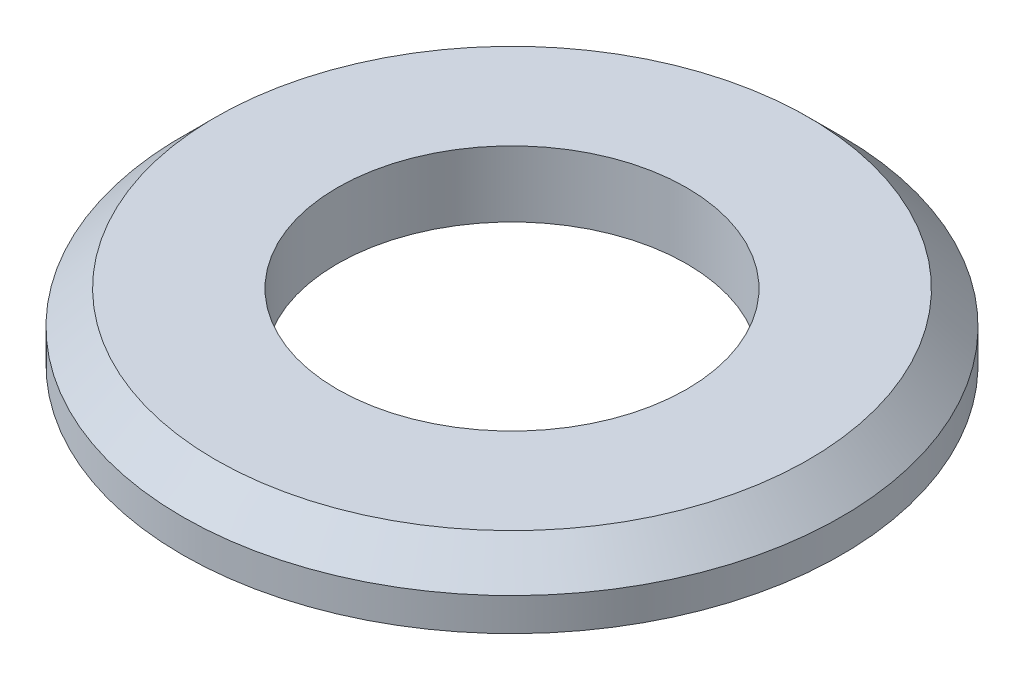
from build123d import *

# Parameters (mm, degrees)
SKETCH1_R      = 5
SKETCH1_R_2    = 2.65
EXTRUDE1_DEPTH = 1
CHAMFER1_SIZE  = 0.5


with BuildPart() as part:
    # Sketch1 → Extrude1 (new body)
    with BuildSketch(Plane(origin=(0, 0, 0), x_dir=(1, 0, 0), z_dir=(0, 1, 0))):
        with Locations(Location((0, 0, 0), (0, 0, 270))):
            Circle(SKETCH1_R)
        with Locations(Location((0, 0, 0), (0, 0, 270))):
            Circle(SKETCH1_R_2, mode=Mode.SUBTRACT)
    extrude(amount=EXTRUDE1_DEPTH)

    # Chamfer1
    chamfer1_edges = [part.edges().sort_by_distance(p)[0] for p in [
        (0, 1, -5),
    ]]
    chamfer(chamfer1_edges, length=CHAMFER1_SIZE)


solid = part.part
